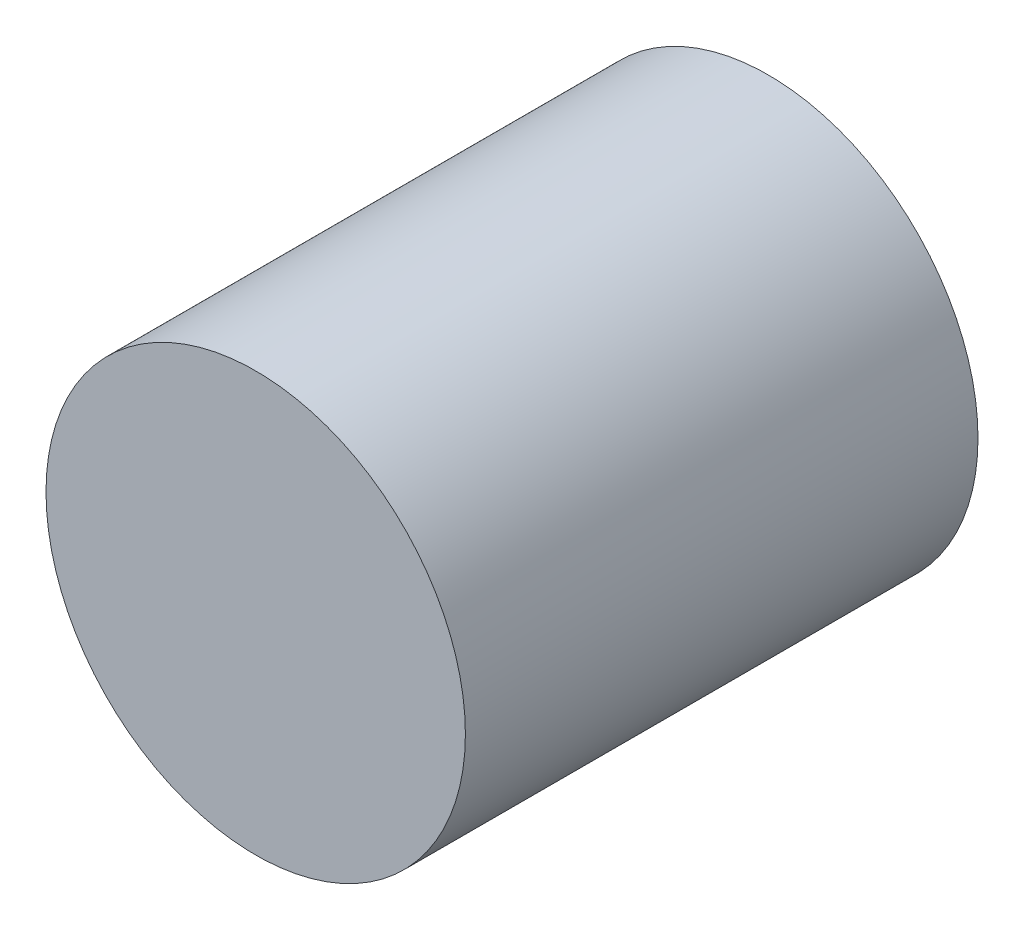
from build123d import *

# Parameters (mm, degrees)
SKETCH1_R           = 4.5
BOSS_EXTRUDE1_DEPTH = 5
SKETCH2_R           = 4.425
CUT_EXTRUDE1_DEPTH  = 254
BOSS_EXTRUDE2_START = 6
SKETCH1_2_R         = 4.5
BOSS_EXTRUDE2_DEPTH = 1


with BuildPart() as part:
    # Sketch1 → Boss-Extrude1 (new, symmetric)
    with BuildSketch(Plane.XY):
        Circle(SKETCH1_R)
    extrude(amount=BOSS_EXTRUDE1_DEPTH, both=True)

    # Sketch2 → Cut-Extrude1 (cut)
    with BuildSketch(Plane.XY.offset(5)):
        Circle(SKETCH2_R)
    extrude(amount=-CUT_EXTRUDE1_DEPTH, mode=Mode.SUBTRACT)

    # Sketch1_2 → Boss-Extrude2 (add)
    with BuildSketch(Plane.XY.offset(BOSS_EXTRUDE2_START)):
        Circle(SKETCH1_2_R)
    extrude(amount=-BOSS_EXTRUDE2_DEPTH)


solid = part.part
